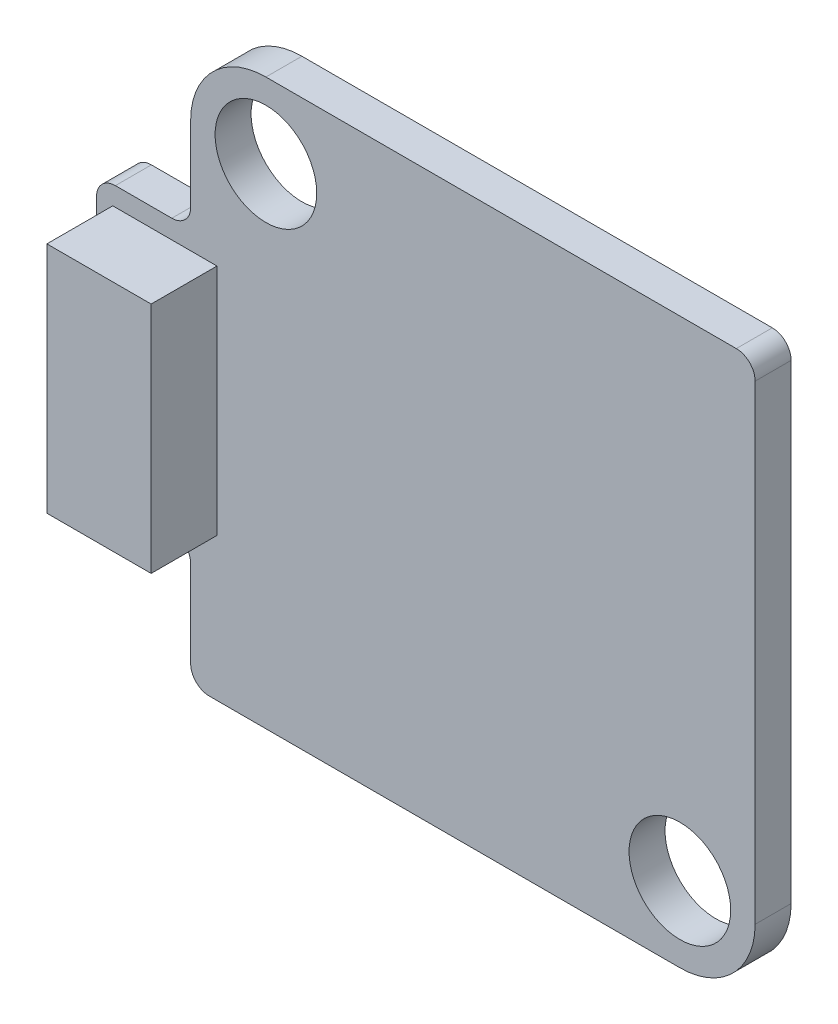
ISO-10303-21;
HEADER;
FILE_DESCRIPTION(('STEP AP214'),'2;1');
FILE_NAME('part.step','',(''),(''),'','','');
FILE_SCHEMA(('AUTOMOTIVE_DESIGN { 1 0 10303 214 1 1 1 1 }'));
ENDSEC;
DATA;
#1=APPLICATION_CONTEXT('core data for automotive mechanical design processes');
#2=APPLICATION_PROTOCOL_DEFINITION('international standard','automotive_design',2000,#1);
#3=PRODUCT_CONTEXT('',#1,'mechanical');
#4=PRODUCT('Part','Part','',(#3));
#5=PRODUCT_RELATED_PRODUCT_CATEGORY('part','',(#4));
#6=PRODUCT_DEFINITION_FORMATION('','',#4);
#7=PRODUCT_DEFINITION_CONTEXT('part definition',#1,'design');
#8=PRODUCT_DEFINITION('design','',#6,#7);
#9=PRODUCT_DEFINITION_SHAPE('','',#8);
#10=(LENGTH_UNIT() NAMED_UNIT(*) SI_UNIT(.MILLI.,.METRE.));
#11=(NAMED_UNIT(*) PLANE_ANGLE_UNIT() SI_UNIT($,.RADIAN.));
#12=(NAMED_UNIT(*) SI_UNIT($,.STERADIAN.) SOLID_ANGLE_UNIT());
#13=UNCERTAINTY_MEASURE_WITH_UNIT(LENGTH_MEASURE(1.E-05),#10,'distance_accuracy_value','');
#14=(GEOMETRIC_REPRESENTATION_CONTEXT(3) GLOBAL_UNCERTAINTY_ASSIGNED_CONTEXT((#13)) GLOBAL_UNIT_ASSIGNED_CONTEXT((#10,
#11,#12)) REPRESENTATION_CONTEXT('',''));
#15=CARTESIAN_POINT('',(0.,0.,0.));
#16=DIRECTION('',(0.,0.,1.));
#17=DIRECTION('',(1.,0.,0.));
#18=AXIS2_PLACEMENT_3D('',#15,#16,#17);
#19=CARTESIAN_POINT('',(-2.06999686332,9.999983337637,0.));
#20=DIRECTION('',(0.999999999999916,-4.09680252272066E-07,0.));
#21=DIRECTION('',(0.,0.,-1.));
#22=AXIS2_PLACEMENT_3D('',#19,#20,#21);
#23=PLANE('',#22);
#24=DIRECTION('',(-4.09680252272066E-07,-0.999999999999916,0.));
#25=VECTOR('',#24,1.);
#26=CARTESIAN_POINT('',(-2.06999686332,9.999983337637,0.));
#27=LINE('',#26,#25);
#28=CARTESIAN_POINT('',(-2.06999686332,9.999983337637,0.));
#29=VERTEX_POINT('',#28);
#30=CARTESIAN_POINT('',(-2.06999940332,3.800026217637,0.));
#31=VERTEX_POINT('',#30);
#32=EDGE_CURVE('P0_E11',#29,#31,#27,.T.);
#33=ORIENTED_EDGE('',*,*,#32,.T.);
#34=DIRECTION('',(0.,0.,1.));
#35=VECTOR('',#34,1.);
#36=CARTESIAN_POINT('',(-2.06999940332,3.800026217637,0.));
#37=LINE('',#36,#35);
#38=CARTESIAN_POINT('',(-2.06999940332,3.800026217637,1.74999904));
#39=VERTEX_POINT('',#38);
#40=EDGE_CURVE('P0_E28',#31,#39,#37,.T.);
#41=ORIENTED_EDGE('',*,*,#40,.T.);
#42=DIRECTION('',(-4.09680252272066E-07,-0.999999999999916,0.));
#43=VECTOR('',#42,1.);
#44=CARTESIAN_POINT('',(-2.06999686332,9.999983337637,1.74999904));
#45=LINE('',#44,#43);
#46=CARTESIAN_POINT('',(-2.06999686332,9.999983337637,1.74999904));
#47=VERTEX_POINT('',#46);
#48=EDGE_CURVE('P0_E87',#47,#39,#45,.T.);
#49=ORIENTED_EDGE('',*,*,#48,.F.);
#50=DIRECTION('',(0.,0.,1.));
#51=VECTOR('',#50,1.);
#52=CARTESIAN_POINT('',(-2.06999686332,9.999983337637,0.));
#53=LINE('',#52,#51);
#54=EDGE_CURVE('P0_E83',#29,#47,#53,.T.);
#55=ORIENTED_EDGE('',*,*,#54,.F.);
#56=EDGE_LOOP('',(#33,#41,#49,#55));
#57=FACE_BOUND('',#56,.T.);
#58=ADVANCED_FACE('P0_F17',(#57),#23,.F.);
#59=CARTESIAN_POINT('',(-2.06999940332,3.800026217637,0.));
#60=DIRECTION('',(0.,1.,0.));
#61=DIRECTION('',(1.,0.,0.));
#62=AXIS2_PLACEMENT_3D('',#59,#60,#61);
#63=PLANE('',#62);
#64=DIRECTION('',(1.,0.,0.));
#65=VECTOR('',#64,1.);
#66=CARTESIAN_POINT('',(-2.06999940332,3.800026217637,0.));
#67=LINE('',#66,#65);
#68=CARTESIAN_POINT('',(0.70002299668,3.800026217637,0.));
#69=VERTEX_POINT('',#68);
#70=EDGE_CURVE('P0_E104',#31,#69,#67,.T.);
#71=ORIENTED_EDGE('',*,*,#70,.T.);
#72=DIRECTION('',(0.,0.,1.));
#73=VECTOR('',#72,1.);
#74=CARTESIAN_POINT('',(0.70002299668,3.800026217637,0.));
#75=LINE('',#74,#73);
#76=CARTESIAN_POINT('',(0.70002299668,3.800026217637,1.74999904));
#77=VERTEX_POINT('',#76);
#78=EDGE_CURVE('P0_E75',#69,#77,#75,.T.);
#79=ORIENTED_EDGE('',*,*,#78,.T.);
#80=DIRECTION('',(1.,0.,0.));
#81=VECTOR('',#80,1.);
#82=CARTESIAN_POINT('',(-2.06999940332,3.800026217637,1.74999904));
#83=LINE('',#82,#81);
#84=EDGE_CURVE('P0_E89',#39,#77,#83,.T.);
#85=ORIENTED_EDGE('',*,*,#84,.F.);
#86=ORIENTED_EDGE('',*,*,#40,.F.);
#87=EDGE_LOOP('',(#71,#79,#85,#86));
#88=FACE_BOUND('',#87,.T.);
#89=ADVANCED_FACE('P0_F135',(#88),#63,.F.);
#90=CARTESIAN_POINT('',(0.70002299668,3.800026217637,0.));
#91=DIRECTION('',(-1.,0.,0.));
#92=DIRECTION('',(0.,0.,1.));
#93=AXIS2_PLACEMENT_3D('',#90,#91,#92);
#94=PLANE('',#93);
#95=DIRECTION('',(0.,1.,0.));
#96=VECTOR('',#95,1.);
#97=CARTESIAN_POINT('',(0.70002299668,3.800026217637,0.));
#98=LINE('',#97,#96);
#99=CARTESIAN_POINT('',(0.70002299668,9.999983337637,0.));
#100=VERTEX_POINT('',#99);
#101=EDGE_CURVE('P0_E112',#69,#100,#98,.T.);
#102=ORIENTED_EDGE('',*,*,#101,.T.);
#103=DIRECTION('',(0.,0.,1.));
#104=VECTOR('',#103,1.);
#105=CARTESIAN_POINT('',(0.70002299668,9.999983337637,0.));
#106=LINE('',#105,#104);
#107=CARTESIAN_POINT('',(0.70002299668,9.999983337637,1.74999904));
#108=VERTEX_POINT('',#107);
#109=EDGE_CURVE('P0_E21',#100,#108,#106,.T.);
#110=ORIENTED_EDGE('',*,*,#109,.T.);
#111=DIRECTION('',(0.,1.,0.));
#112=VECTOR('',#111,1.);
#113=CARTESIAN_POINT('',(0.70002299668,3.800026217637,1.74999904));
#114=LINE('',#113,#112);
#115=EDGE_CURVE('P0_E54',#77,#108,#114,.T.);
#116=ORIENTED_EDGE('',*,*,#115,.F.);
#117=ORIENTED_EDGE('',*,*,#78,.F.);
#118=EDGE_LOOP('',(#102,#110,#116,#117));
#119=FACE_BOUND('',#118,.T.);
#120=ADVANCED_FACE('P0_F121',(#119),#94,.F.);
#121=CARTESIAN_POINT('',(0.70002299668,9.999983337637,0.));
#122=DIRECTION('',(0.,-1.,0.));
#123=DIRECTION('',(0.,0.,-1.));
#124=AXIS2_PLACEMENT_3D('',#121,#122,#123);
#125=PLANE('',#124);
#126=DIRECTION('',(-1.,0.,0.));
#127=VECTOR('',#126,1.);
#128=CARTESIAN_POINT('',(0.70002299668,9.999983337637,0.));
#129=LINE('',#128,#127);
#130=EDGE_CURVE('P0_E93',#100,#29,#129,.T.);
#131=ORIENTED_EDGE('',*,*,#130,.T.);
#132=ORIENTED_EDGE('',*,*,#54,.T.);
#133=DIRECTION('',(-1.,0.,0.));
#134=VECTOR('',#133,1.);
#135=CARTESIAN_POINT('',(0.70002299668,9.999983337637,1.74999904));
#136=LINE('',#135,#134);
#137=EDGE_CURVE('P0_E91',#108,#47,#136,.T.);
#138=ORIENTED_EDGE('',*,*,#137,.F.);
#139=ORIENTED_EDGE('',*,*,#109,.F.);
#140=EDGE_LOOP('',(#131,#132,#138,#139));
#141=FACE_BOUND('',#140,.T.);
#142=ADVANCED_FACE('P0_F19',(#141),#125,.F.);
#143=CARTESIAN_POINT('',(-2.06999686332,9.999983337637,0.));
#144=DIRECTION('',(0.,0.,-1.));
#145=DIRECTION('',(0.,-1.,0.));
#146=AXIS2_PLACEMENT_3D('',#143,#144,#145);
#147=PLANE('',#146);
#148=ORIENTED_EDGE('',*,*,#130,.F.);
#149=ORIENTED_EDGE('',*,*,#101,.F.);
#150=ORIENTED_EDGE('',*,*,#70,.F.);
#151=ORIENTED_EDGE('',*,*,#32,.F.);
#152=EDGE_LOOP('',(#148,#149,#150,#151));
#153=FACE_BOUND('',#152,.T.);
#154=ADVANCED_FACE('P0_F123',(#153),#147,.T.);
#155=CARTESIAN_POINT('',(-2.06999686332,9.999983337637,1.74999904));
#156=DIRECTION('',(0.,0.,-1.));
#157=DIRECTION('',(0.,-1.,0.));
#158=AXIS2_PLACEMENT_3D('',#155,#156,#157);
#159=PLANE('',#158);
#160=ORIENTED_EDGE('',*,*,#48,.T.);
#161=ORIENTED_EDGE('',*,*,#84,.T.);
#162=ORIENTED_EDGE('',*,*,#115,.T.);
#163=ORIENTED_EDGE('',*,*,#137,.T.);
#164=EDGE_LOOP('',(#160,#161,#162,#163));
#165=FACE_BOUND('',#164,.T.);
#166=ADVANCED_FACE('P0_F96',(#165),#159,.F.);
#167=CLOSED_SHELL('',(#58,#89,#120,#142,#154,#166));
#168=MANIFOLD_SOLID_BREP('P0_B1',#167);
#169=CARTESIAN_POINT('',(-2.001519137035,3.798480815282,-0.95600012));
#170=DIRECTION('',(0.,0.,-1.));
#171=DIRECTION('',(0.00304751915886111,-0.999995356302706,0.));
#172=AXIS2_PLACEMENT_3D('',#169,#170,#171);
#173=CYLINDRICAL_SURFACE('',#172,0.49848317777);
#174=DIRECTION('',(0.,0.,1.));
#175=VECTOR('',#174,1.);
#176=CARTESIAN_POINT('',(-2.,3.299999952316,-0.95600012));
#177=LINE('',#176,#175);
#178=CARTESIAN_POINT('',(-2.,3.299999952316,-0.95600012));
#179=VERTEX_POINT('',#178);
#180=CARTESIAN_POINT('',(-2.,3.299999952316,0.));
#181=VERTEX_POINT('',#180);
#182=EDGE_CURVE('P1_E11',#179,#181,#177,.T.);
#183=ORIENTED_EDGE('',*,*,#182,.T.);
#184=CARTESIAN_POINT('',(-2.001519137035,3.798480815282,0.));
#185=DIRECTION('',(0.,0.,-1.));
#186=DIRECTION('',(0.00304751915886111,-0.999995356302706,0.));
#187=AXIS2_PLACEMENT_3D('',#184,#185,#186);
#188=CIRCLE('',#187,0.49848317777);
#189=CARTESIAN_POINT('',(-2.5,3.799999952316,0.));
#190=VERTEX_POINT('',#189);
#191=EDGE_CURVE('P1_E28',#181,#190,#188,.T.);
#192=ORIENTED_EDGE('',*,*,#191,.T.);
#193=DIRECTION('',(0.,0.,1.));
#194=VECTOR('',#193,1.);
#195=CARTESIAN_POINT('',(-2.5,3.799999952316,-0.95600012));
#196=LINE('',#195,#194);
#197=CARTESIAN_POINT('',(-2.5,3.799999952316,-0.95600012));
#198=VERTEX_POINT('',#197);
#199=EDGE_CURVE('P1_E260',#198,#190,#196,.T.);
#200=ORIENTED_EDGE('',*,*,#199,.F.);
#201=CARTESIAN_POINT('',(-2.001519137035,3.798480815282,-0.95600012));
#202=DIRECTION('',(0.,0.,-1.));
#203=DIRECTION('',(0.00304751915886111,-0.999995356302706,0.));
#204=AXIS2_PLACEMENT_3D('',#201,#202,#203);
#205=CIRCLE('',#204,0.49848317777);
#206=EDGE_CURVE('P1_E315',#179,#198,#205,.T.);
#207=ORIENTED_EDGE('',*,*,#206,.F.);
#208=EDGE_LOOP('',(#183,#192,#200,#207));
#209=FACE_BOUND('',#208,.T.);
#210=ADVANCED_FACE('P1_F17',(#209),#173,.T.);
#211=CARTESIAN_POINT('',(-2.5,3.799999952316,-0.95600012));
#212=DIRECTION('',(-1.,0.,0.));
#213=DIRECTION('',(0.,0.,1.));
#214=AXIS2_PLACEMENT_3D('',#211,#212,#213);
#215=PLANE('',#214);
#216=ORIENTED_EDGE('',*,*,#199,.T.);
#217=DIRECTION('',(0.,1.,0.));
#218=VECTOR('',#217,1.);
#219=CARTESIAN_POINT('',(-2.5,3.799999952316,0.));
#220=LINE('',#219,#218);
#221=CARTESIAN_POINT('',(-2.5,10.,0.));
#222=VERTEX_POINT('',#221);
#223=EDGE_CURVE('P1_E368',#190,#222,#220,.T.);
#224=ORIENTED_EDGE('',*,*,#223,.T.);
#225=DIRECTION('',(0.,0.,1.));
#226=VECTOR('',#225,1.);
#227=CARTESIAN_POINT('',(-2.5,10.,-0.95600012));
#228=LINE('',#227,#226);
#229=CARTESIAN_POINT('',(-2.5,10.,-0.95600012));
#230=VERTEX_POINT('',#229);
#231=EDGE_CURVE('P1_E332',#230,#222,#228,.T.);
#232=ORIENTED_EDGE('',*,*,#231,.F.);
#233=DIRECTION('',(0.,1.,0.));
#234=VECTOR('',#233,1.);
#235=CARTESIAN_POINT('',(-2.5,3.799999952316,-0.95600012));
#236=LINE('',#235,#234);
#237=EDGE_CURVE('P1_E114',#198,#230,#236,.T.);
#238=ORIENTED_EDGE('',*,*,#237,.F.);
#239=EDGE_LOOP('',(#216,#224,#232,#238));
#240=FACE_BOUND('',#239,.T.);
#241=ADVANCED_FACE('P1_F429',(#240),#215,.T.);
#242=CARTESIAN_POINT('',(-2.001519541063,10.001519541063,-0.95600012));
#243=DIRECTION('',(0.,0.,-1.));
#244=DIRECTION('',(-0.999995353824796,-0.00304833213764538,0.));
#245=AXIS2_PLACEMENT_3D('',#242,#243,#244);
#246=CYLINDRICAL_SURFACE('',#245,0.498482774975);
#247=ORIENTED_EDGE('',*,*,#231,.T.);
#248=CARTESIAN_POINT('',(-2.001519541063,10.001519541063,0.));
#249=DIRECTION('',(0.,0.,-1.));
#250=DIRECTION('',(-0.999995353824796,-0.00304833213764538,0.));
#251=AXIS2_PLACEMENT_3D('',#248,#249,#250);
#252=CIRCLE('',#251,0.498482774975);
#253=CARTESIAN_POINT('',(-2.,10.5,0.));
#254=VERTEX_POINT('',#253);
#255=EDGE_CURVE('P1_E329',#222,#254,#252,.T.);
#256=ORIENTED_EDGE('',*,*,#255,.T.);
#257=DIRECTION('',(0.,0.,1.));
#258=VECTOR('',#257,1.);
#259=CARTESIAN_POINT('',(-2.,10.5,-0.95600012));
#260=LINE('',#259,#258);
#261=CARTESIAN_POINT('',(-2.,10.5,-0.95600012));
#262=VERTEX_POINT('',#261);
#263=EDGE_CURVE('P1_E129',#262,#254,#260,.T.);
#264=ORIENTED_EDGE('',*,*,#263,.F.);
#265=CARTESIAN_POINT('',(-2.001519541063,10.001519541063,-0.95600012));
#266=DIRECTION('',(0.,0.,-1.));
#267=DIRECTION('',(-0.999995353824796,-0.00304833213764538,0.));
#268=AXIS2_PLACEMENT_3D('',#265,#266,#267);
#269=CIRCLE('',#268,0.498482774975);
#270=EDGE_CURVE('P1_E254',#230,#262,#269,.T.);
#271=ORIENTED_EDGE('',*,*,#270,.F.);
#272=EDGE_LOOP('',(#247,#256,#264,#271));
#273=FACE_BOUND('',#272,.T.);
#274=ADVANCED_FACE('P1_F435',(#273),#246,.T.);
#275=CARTESIAN_POINT('',(-2.,10.5,-0.95600012));
#276=DIRECTION('',(0.,1.,0.));
#277=DIRECTION('',(1.,0.,0.));
#278=AXIS2_PLACEMENT_3D('',#275,#276,#277);
#279=PLANE('',#278);
#280=ORIENTED_EDGE('',*,*,#263,.T.);
#281=DIRECTION('',(1.,0.,0.));
#282=VECTOR('',#281,1.);
#283=CARTESIAN_POINT('',(-2.,10.5,0.));
#284=LINE('',#283,#282);
#285=CARTESIAN_POINT('',(-0.5,10.5,0.));
#286=VERTEX_POINT('',#285);
#287=EDGE_CURVE('P1_E229',#254,#286,#284,.T.);
#288=ORIENTED_EDGE('',*,*,#287,.T.);
#289=DIRECTION('',(0.,0.,1.));
#290=VECTOR('',#289,1.);
#291=CARTESIAN_POINT('',(-0.5,10.5,-0.95600012));
#292=LINE('',#291,#290);
#293=CARTESIAN_POINT('',(-0.5,10.5,-0.95600012));
#294=VERTEX_POINT('',#293);
#295=EDGE_CURVE('P1_E221',#294,#286,#292,.T.);
#296=ORIENTED_EDGE('',*,*,#295,.F.);
#297=DIRECTION('',(1.,0.,0.));
#298=VECTOR('',#297,1.);
#299=CARTESIAN_POINT('',(-2.,10.5,-0.95600012));
#300=LINE('',#299,#298);
#301=EDGE_CURVE('P1_E257',#262,#294,#300,.T.);
#302=ORIENTED_EDGE('',*,*,#301,.F.);
#303=EDGE_LOOP('',(#280,#288,#296,#302));
#304=FACE_BOUND('',#303,.T.);
#305=ADVANCED_FACE('P1_F232',(#304),#279,.T.);
#306=CARTESIAN_POINT('',(-0.498480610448,10.998480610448,-0.95600012));
#307=DIRECTION('',(0.,0.,-1.));
#308=DIRECTION('',(-0.00304802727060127,-0.99999535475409,0.));
#309=AXIS2_PLACEMENT_3D('',#306,#307,#308);
#310=CYLINDRICAL_SURFACE('',#309,0.498482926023);
#311=ORIENTED_EDGE('',*,*,#295,.T.);
#312=CARTESIAN_POINT('',(-0.498480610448,10.998480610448,0.));
#313=DIRECTION('',(0.,0.,1.));
#314=DIRECTION('',(-0.00304802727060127,-0.99999535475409,0.));
#315=AXIS2_PLACEMENT_3D('',#312,#313,#314);
#316=CIRCLE('',#315,0.498482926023);
#317=CARTESIAN_POINT('',(0.,11.,0.));
#318=VERTEX_POINT('',#317);
#319=EDGE_CURVE('P1_E225',#286,#318,#316,.T.);
#320=ORIENTED_EDGE('',*,*,#319,.T.);
#321=DIRECTION('',(0.,0.,1.));
#322=VECTOR('',#321,1.);
#323=CARTESIAN_POINT('',(0.,11.,-0.95600012));
#324=LINE('',#323,#322);
#325=CARTESIAN_POINT('',(0.,11.,-0.95600012));
#326=VERTEX_POINT('',#325);
#327=EDGE_CURVE('P1_E242',#326,#318,#324,.T.);
#328=ORIENTED_EDGE('',*,*,#327,.F.);
#329=CARTESIAN_POINT('',(-0.498480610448,10.998480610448,-0.95600012));
#330=DIRECTION('',(0.,0.,1.));
#331=DIRECTION('',(-0.00304802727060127,-0.99999535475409,0.));
#332=AXIS2_PLACEMENT_3D('',#329,#330,#331);
#333=CIRCLE('',#332,0.498482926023);
#334=EDGE_CURVE('P1_E227',#294,#326,#333,.T.);
#335=ORIENTED_EDGE('',*,*,#334,.F.);
#336=EDGE_LOOP('',(#311,#320,#328,#335));
#337=FACE_BOUND('',#336,.T.);
#338=ADVANCED_FACE('P1_F222',(#337),#310,.F.);
#339=CARTESIAN_POINT('',(0.,11.,-0.95600012));
#340=DIRECTION('',(-1.,0.,0.));
#341=DIRECTION('',(0.,0.,1.));
#342=AXIS2_PLACEMENT_3D('',#339,#340,#341);
#343=PLANE('',#342);
#344=ORIENTED_EDGE('',*,*,#327,.T.);
#345=DIRECTION('',(0.,1.,0.));
#346=VECTOR('',#345,1.);
#347=CARTESIAN_POINT('',(0.,11.,0.));
#348=LINE('',#347,#346);
#349=CARTESIAN_POINT('',(0.,13.,0.));
#350=VERTEX_POINT('',#349);
#351=EDGE_CURVE('P1_E240',#318,#350,#348,.T.);
#352=ORIENTED_EDGE('',*,*,#351,.T.);
#353=DIRECTION('',(0.,0.,1.));
#354=VECTOR('',#353,1.);
#355=CARTESIAN_POINT('',(0.,13.,-0.95600012));
#356=LINE('',#355,#354);
#357=CARTESIAN_POINT('',(0.,13.,-0.95600012));
#358=VERTEX_POINT('',#357);
#359=EDGE_CURVE('P1_E262',#358,#350,#356,.T.);
#360=ORIENTED_EDGE('',*,*,#359,.F.);
#361=DIRECTION('',(0.,1.,0.));
#362=VECTOR('',#361,1.);
#363=CARTESIAN_POINT('',(0.,11.,-0.95600012));
#364=LINE('',#363,#362);
#365=EDGE_CURVE('P1_E287',#326,#358,#364,.T.);
#366=ORIENTED_EDGE('',*,*,#365,.F.);
#367=EDGE_LOOP('',(#344,#352,#360,#366));
#368=FACE_BOUND('',#367,.T.);
#369=ADVANCED_FACE('P1_F439',(#368),#343,.T.);
#370=CARTESIAN_POINT('',(2.000730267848,12.999269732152,-0.95600012));
#371=DIRECTION('',(0.,0.,-1.));
#372=DIRECTION('',(-0.999999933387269,0.000365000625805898,0.));
#373=AXIS2_PLACEMENT_3D('',#370,#371,#372);
#374=CYLINDRICAL_SURFACE('',#373,2.000730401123);
#375=ORIENTED_EDGE('',*,*,#359,.T.);
#376=CARTESIAN_POINT('',(2.000730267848,12.999269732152,0.));
#377=DIRECTION('',(0.,0.,-1.));
#378=DIRECTION('',(-0.999999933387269,0.000365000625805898,0.));
#379=AXIS2_PLACEMENT_3D('',#376,#377,#378);
#380=CIRCLE('',#379,2.000730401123);
#381=CARTESIAN_POINT('',(2.,15.,0.));
#382=VERTEX_POINT('',#381);
#383=EDGE_CURVE('P1_E280',#350,#382,#380,.T.);
#384=ORIENTED_EDGE('',*,*,#383,.T.);
#385=DIRECTION('',(0.,0.,1.));
#386=VECTOR('',#385,1.);
#387=CARTESIAN_POINT('',(2.,15.,-0.95600012));
#388=LINE('',#387,#386);
#389=CARTESIAN_POINT('',(2.,15.,-0.95600012));
#390=VERTEX_POINT('',#389);
#391=EDGE_CURVE('P1_E284',#390,#382,#388,.T.);
#392=ORIENTED_EDGE('',*,*,#391,.F.);
#393=CARTESIAN_POINT('',(2.000730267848,12.999269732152,-0.95600012));
#394=DIRECTION('',(0.,0.,-1.));
#395=DIRECTION('',(-0.999999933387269,0.000365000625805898,0.));
#396=AXIS2_PLACEMENT_3D('',#393,#394,#395);
#397=CIRCLE('',#396,2.000730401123);
#398=EDGE_CURVE('P1_E253',#358,#390,#397,.T.);
#399=ORIENTED_EDGE('',*,*,#398,.F.);
#400=EDGE_LOOP('',(#375,#384,#392,#399));
#401=FACE_BOUND('',#400,.T.);
#402=ADVANCED_FACE('P1_F442',(#401),#374,.T.);
#403=CARTESIAN_POINT('',(2.,15.,-0.95600012));
#404=DIRECTION('',(0.,1.,0.));
#405=DIRECTION('',(1.,0.,0.));
#406=AXIS2_PLACEMENT_3D('',#403,#404,#405);
#407=PLANE('',#406);
#408=ORIENTED_EDGE('',*,*,#391,.T.);
#409=DIRECTION('',(1.,0.,0.));
#410=VECTOR('',#409,1.);
#411=CARTESIAN_POINT('',(2.,15.,0.));
#412=LINE('',#411,#410);
#413=CARTESIAN_POINT('',(14.5,15.,0.));
#414=VERTEX_POINT('',#413);
#415=EDGE_CURVE('P1_E290',#382,#414,#412,.T.);
#416=ORIENTED_EDGE('',*,*,#415,.T.);
#417=DIRECTION('',(0.,0.,1.));
#418=VECTOR('',#417,1.);
#419=CARTESIAN_POINT('',(14.5,15.,-0.95600012));
#420=LINE('',#419,#418);
#421=CARTESIAN_POINT('',(14.5,15.,-0.95600012));
#422=VERTEX_POINT('',#421);
#423=EDGE_CURVE('P1_E177',#422,#414,#420,.T.);
#424=ORIENTED_EDGE('',*,*,#423,.F.);
#425=DIRECTION('',(1.,0.,0.));
#426=VECTOR('',#425,1.);
#427=CARTESIAN_POINT('',(2.,15.,-0.95600012));
#428=LINE('',#427,#426);
#429=EDGE_CURVE('P1_E189',#390,#422,#428,.T.);
#430=ORIENTED_EDGE('',*,*,#429,.F.);
#431=EDGE_LOOP('',(#408,#416,#424,#430));
#432=FACE_BOUND('',#431,.T.);
#433=ADVANCED_FACE('P1_F391',(#432),#407,.T.);
#434=CARTESIAN_POINT('',(14.501519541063,14.501519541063,-0.95600012));
#435=DIRECTION('',(0.,0.,-1.));
#436=DIRECTION('',(-0.00304833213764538,0.999995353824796,0.));
#437=AXIS2_PLACEMENT_3D('',#434,#435,#436);
#438=CYLINDRICAL_SURFACE('',#437,0.498482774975);
#439=ORIENTED_EDGE('',*,*,#423,.T.);
#440=CARTESIAN_POINT('',(14.501519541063,14.501519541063,0.));
#441=DIRECTION('',(0.,0.,-1.));
#442=DIRECTION('',(-0.00304833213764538,0.999995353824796,0.));
#443=AXIS2_PLACEMENT_3D('',#440,#441,#442);
#444=CIRCLE('',#443,0.498482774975);
#445=CARTESIAN_POINT('',(15.,14.5,0.));
#446=VERTEX_POINT('',#445);
#447=EDGE_CURVE('P1_E291',#414,#446,#444,.T.);
#448=ORIENTED_EDGE('',*,*,#447,.T.);
#449=DIRECTION('',(0.,0.,1.));
#450=VECTOR('',#449,1.);
#451=CARTESIAN_POINT('',(15.,14.5,-0.95600012));
#452=LINE('',#451,#450);
#453=CARTESIAN_POINT('',(15.,14.5,-0.95600012));
#454=VERTEX_POINT('',#453);
#455=EDGE_CURVE('P1_E339',#454,#446,#452,.T.);
#456=ORIENTED_EDGE('',*,*,#455,.F.);
#457=CARTESIAN_POINT('',(14.501519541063,14.501519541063,-0.95600012));
#458=DIRECTION('',(0.,0.,-1.));
#459=DIRECTION('',(-0.00304833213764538,0.999995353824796,0.));
#460=AXIS2_PLACEMENT_3D('',#457,#458,#459);
#461=CIRCLE('',#460,0.498482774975);
#462=EDGE_CURVE('P1_E201',#422,#454,#461,.T.);
#463=ORIENTED_EDGE('',*,*,#462,.F.);
#464=EDGE_LOOP('',(#439,#448,#456,#463));
#465=FACE_BOUND('',#464,.T.);
#466=ADVANCED_FACE('P1_F395',(#465),#438,.T.);
#467=CARTESIAN_POINT('',(15.,14.5,-0.95600012));
#468=DIRECTION('',(1.,0.,0.));
#469=DIRECTION('',(0.,1.,0.));
#470=AXIS2_PLACEMENT_3D('',#467,#468,#469);
#471=PLANE('',#470);
#472=ORIENTED_EDGE('',*,*,#455,.T.);
#473=DIRECTION('',(0.,-1.,0.));
#474=VECTOR('',#473,1.);
#475=CARTESIAN_POINT('',(15.,14.5,0.));
#476=LINE('',#475,#474);
#477=CARTESIAN_POINT('',(15.,2.,0.));
#478=VERTEX_POINT('',#477);
#479=EDGE_CURVE('P1_E355',#446,#478,#476,.T.);
#480=ORIENTED_EDGE('',*,*,#479,.T.);
#481=DIRECTION('',(0.,0.,1.));
#482=VECTOR('',#481,1.);
#483=CARTESIAN_POINT('',(15.,2.,-0.95600012));
#484=LINE('',#483,#482);
#485=CARTESIAN_POINT('',(15.,2.,-0.95600012));
#486=VERTEX_POINT('',#485);
#487=EDGE_CURVE('P1_E210',#486,#478,#484,.T.);
#488=ORIENTED_EDGE('',*,*,#487,.F.);
#489=DIRECTION('',(0.,-1.,0.));
#490=VECTOR('',#489,1.);
#491=CARTESIAN_POINT('',(15.,14.5,-0.95600012));
#492=LINE('',#491,#490);
#493=EDGE_CURVE('P1_E266',#454,#486,#492,.T.);
#494=ORIENTED_EDGE('',*,*,#493,.F.);
#495=EDGE_LOOP('',(#472,#480,#488,#494));
#496=FACE_BOUND('',#495,.T.);
#497=ADVANCED_FACE('P1_F400',(#496),#471,.T.);
#498=CARTESIAN_POINT('',(12.999269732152,2.000730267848,-0.95600012));
#499=DIRECTION('',(0.,0.,-1.));
#500=DIRECTION('',(0.999999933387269,-0.000365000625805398,0.));
#501=AXIS2_PLACEMENT_3D('',#498,#499,#500);
#502=CYLINDRICAL_SURFACE('',#501,2.000730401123);
#503=ORIENTED_EDGE('',*,*,#487,.T.);
#504=CARTESIAN_POINT('',(12.999269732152,2.000730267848,0.));
#505=DIRECTION('',(0.,0.,-1.));
#506=DIRECTION('',(0.999999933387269,-0.000365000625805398,0.));
#507=AXIS2_PLACEMENT_3D('',#504,#505,#506);
#508=CIRCLE('',#507,2.000730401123);
#509=CARTESIAN_POINT('',(13.,0.,0.));
#510=VERTEX_POINT('',#509);
#511=EDGE_CURVE('P1_E272',#478,#510,#508,.T.);
#512=ORIENTED_EDGE('',*,*,#511,.T.);
#513=DIRECTION('',(0.,0.,1.));
#514=VECTOR('',#513,1.);
#515=CARTESIAN_POINT('',(13.,0.,-0.95600012));
#516=LINE('',#515,#514);
#517=CARTESIAN_POINT('',(13.,0.,-0.95600012));
#518=VERTEX_POINT('',#517);
#519=EDGE_CURVE('P1_E269',#518,#510,#516,.T.);
#520=ORIENTED_EDGE('',*,*,#519,.F.);
#521=CARTESIAN_POINT('',(12.999269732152,2.000730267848,-0.95600012));
#522=DIRECTION('',(0.,0.,-1.));
#523=DIRECTION('',(0.999999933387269,-0.000365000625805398,0.));
#524=AXIS2_PLACEMENT_3D('',#521,#522,#523);
#525=CIRCLE('',#524,2.000730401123);
#526=EDGE_CURVE('P1_E21',#486,#518,#525,.T.);
#527=ORIENTED_EDGE('',*,*,#526,.F.);
#528=EDGE_LOOP('',(#503,#512,#520,#527));
#529=FACE_BOUND('',#528,.T.);
#530=ADVANCED_FACE('P1_F406',(#529),#502,.T.);
#531=CARTESIAN_POINT('',(13.,0.,-0.95600012));
#532=DIRECTION('',(0.,-1.,0.));
#533=DIRECTION('',(0.,0.,-1.));
#534=AXIS2_PLACEMENT_3D('',#531,#532,#533);
#535=PLANE('',#534);
#536=ORIENTED_EDGE('',*,*,#519,.T.);
#537=DIRECTION('',(-1.,0.,0.));
#538=VECTOR('',#537,1.);
#539=CARTESIAN_POINT('',(13.,0.,0.));
#540=LINE('',#539,#538);
#541=CARTESIAN_POINT('',(0.5,0.,0.));
#542=VERTEX_POINT('',#541);
#543=EDGE_CURVE('P1_E273',#510,#542,#540,.T.);
#544=ORIENTED_EDGE('',*,*,#543,.T.);
#545=DIRECTION('',(0.,0.,1.));
#546=VECTOR('',#545,1.);
#547=CARTESIAN_POINT('',(0.5,0.,-0.95600012));
#548=LINE('',#547,#546);
#549=CARTESIAN_POINT('',(0.5,0.,-0.95600012));
#550=VERTEX_POINT('',#549);
#551=EDGE_CURVE('P1_E295',#550,#542,#548,.T.);
#552=ORIENTED_EDGE('',*,*,#551,.F.);
#553=DIRECTION('',(-1.,0.,0.));
#554=VECTOR('',#553,1.);
#555=CARTESIAN_POINT('',(13.,0.,-0.95600012));
#556=LINE('',#555,#554);
#557=EDGE_CURVE('P1_E312',#518,#550,#556,.T.);
#558=ORIENTED_EDGE('',*,*,#557,.F.);
#559=EDGE_LOOP('',(#536,#544,#552,#558));
#560=FACE_BOUND('',#559,.T.);
#561=ADVANCED_FACE('P1_F409',(#560),#535,.T.);
#562=CARTESIAN_POINT('',(0.498480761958,0.498480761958,-0.95600012));
#563=DIRECTION('',(0.,0.,-1.));
#564=DIRECTION('',(0.00304772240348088,-0.999995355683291,0.));
#565=AXIS2_PLACEMENT_3D('',#562,#563,#564);
#566=CYLINDRICAL_SURFACE('',#565,0.498483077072);
#567=ORIENTED_EDGE('',*,*,#551,.T.);
#568=CARTESIAN_POINT('',(0.498480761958,0.498480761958,0.));
#569=DIRECTION('',(0.,0.,-1.));
#570=DIRECTION('',(0.00304772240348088,-0.999995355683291,0.));
#571=AXIS2_PLACEMENT_3D('',#568,#569,#570);
#572=CIRCLE('',#571,0.498483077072);
#573=CARTESIAN_POINT('',(0.,0.5,0.));
#574=VERTEX_POINT('',#573);
#575=EDGE_CURVE('P1_E321',#542,#574,#572,.T.);
#576=ORIENTED_EDGE('',*,*,#575,.T.);
#577=DIRECTION('',(0.,0.,1.));
#578=VECTOR('',#577,1.);
#579=CARTESIAN_POINT('',(0.,0.5,-0.95600012));
#580=LINE('',#579,#578);
#581=CARTESIAN_POINT('',(0.,0.5,-0.95600012));
#582=VERTEX_POINT('',#581);
#583=EDGE_CURVE('P1_E70',#582,#574,#580,.T.);
#584=ORIENTED_EDGE('',*,*,#583,.F.);
#585=CARTESIAN_POINT('',(0.498480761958,0.498480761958,-0.95600012));
#586=DIRECTION('',(0.,0.,-1.));
#587=DIRECTION('',(0.00304772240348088,-0.999995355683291,0.));
#588=AXIS2_PLACEMENT_3D('',#585,#586,#587);
#589=CIRCLE('',#588,0.498483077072);
#590=EDGE_CURVE('P1_E83',#550,#582,#589,.T.);
#591=ORIENTED_EDGE('',*,*,#590,.F.);
#592=EDGE_LOOP('',(#567,#576,#584,#591));
#593=FACE_BOUND('',#592,.T.);
#594=ADVANCED_FACE('P1_F412',(#593),#566,.T.);
#595=CARTESIAN_POINT('',(0.,0.5,-0.95600012));
#596=DIRECTION('',(-1.,0.,0.));
#597=DIRECTION('',(0.,0.,1.));
#598=AXIS2_PLACEMENT_3D('',#595,#596,#597);
#599=PLANE('',#598);
#600=ORIENTED_EDGE('',*,*,#583,.T.);
#601=DIRECTION('',(0.,1.,0.));
#602=VECTOR('',#601,1.);
#603=CARTESIAN_POINT('',(0.,0.5,0.));
#604=LINE('',#603,#602);
#605=CARTESIAN_POINT('',(0.,2.799999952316,0.));
#606=VERTEX_POINT('',#605);
#607=EDGE_CURVE('P1_E322',#574,#606,#604,.T.);
#608=ORIENTED_EDGE('',*,*,#607,.T.);
#609=DIRECTION('',(0.,0.,1.));
#610=VECTOR('',#609,1.);
#611=CARTESIAN_POINT('',(0.,2.799999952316,-0.95600012));
#612=LINE('',#611,#610);
#613=CARTESIAN_POINT('',(0.,2.799999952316,-0.95600012));
#614=VERTEX_POINT('',#613);
#615=EDGE_CURVE('P1_E357',#614,#606,#612,.T.);
#616=ORIENTED_EDGE('',*,*,#615,.F.);
#617=DIRECTION('',(0.,1.,0.));
#618=VECTOR('',#617,1.);
#619=CARTESIAN_POINT('',(0.,0.5,-0.95600012));
#620=LINE('',#619,#618);
#621=EDGE_CURVE('P1_E341',#582,#614,#620,.T.);
#622=ORIENTED_EDGE('',*,*,#621,.F.);
#623=EDGE_LOOP('',(#600,#608,#616,#622));
#624=FACE_BOUND('',#623,.T.);
#625=ADVANCED_FACE('P1_F414',(#624),#599,.T.);
#626=CARTESIAN_POINT('',(-0.498480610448,2.801519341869,-0.95600012));
#627=DIRECTION('',(0.,0.,-1.));
#628=DIRECTION('',(0.99999535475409,-0.00304802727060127,0.));
#629=AXIS2_PLACEMENT_3D('',#626,#627,#628);
#630=CYLINDRICAL_SURFACE('',#629,0.498482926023);
#631=ORIENTED_EDGE('',*,*,#615,.T.);
#632=CARTESIAN_POINT('',(-0.498480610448,2.801519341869,0.));
#633=DIRECTION('',(0.,0.,1.));
#634=DIRECTION('',(0.99999535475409,-0.00304802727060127,0.));
#635=AXIS2_PLACEMENT_3D('',#632,#633,#634);
#636=CIRCLE('',#635,0.498482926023);
#637=CARTESIAN_POINT('',(-0.5,3.299999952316,0.));
#638=VERTEX_POINT('',#637);
#639=EDGE_CURVE('P1_E309',#606,#638,#636,.T.);
#640=ORIENTED_EDGE('',*,*,#639,.T.);
#641=DIRECTION('',(0.,0.,1.));
#642=VECTOR('',#641,1.);
#643=CARTESIAN_POINT('',(-0.5,3.299999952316,-0.95600012));
#644=LINE('',#643,#642);
#645=CARTESIAN_POINT('',(-0.5,3.299999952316,-0.95600012));
#646=VERTEX_POINT('',#645);
#647=EDGE_CURVE('P1_E305',#646,#638,#644,.T.);
#648=ORIENTED_EDGE('',*,*,#647,.F.);
#649=CARTESIAN_POINT('',(-0.498480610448,2.801519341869,-0.95600012));
#650=DIRECTION('',(0.,0.,1.));
#651=DIRECTION('',(0.99999535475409,-0.00304802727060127,0.));
#652=AXIS2_PLACEMENT_3D('',#649,#650,#651);
#653=CIRCLE('',#652,0.498482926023);
#654=EDGE_CURVE('P1_E326',#614,#646,#653,.T.);
#655=ORIENTED_EDGE('',*,*,#654,.F.);
#656=EDGE_LOOP('',(#631,#640,#648,#655));
#657=FACE_BOUND('',#656,.T.);
#658=ADVANCED_FACE('P1_F419',(#657),#630,.F.);
#659=CARTESIAN_POINT('',(-0.5,3.299999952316,-0.95600012));
#660=DIRECTION('',(0.,-1.,0.));
#661=DIRECTION('',(0.,0.,-1.));
#662=AXIS2_PLACEMENT_3D('',#659,#660,#661);
#663=PLANE('',#662);
#664=ORIENTED_EDGE('',*,*,#647,.T.);
#665=DIRECTION('',(-1.,0.,0.));
#666=VECTOR('',#665,1.);
#667=CARTESIAN_POINT('',(-0.5,3.299999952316,0.));
#668=LINE('',#667,#666);
#669=EDGE_CURVE('P1_E278',#638,#181,#668,.T.);
#670=ORIENTED_EDGE('',*,*,#669,.T.);
#671=ORIENTED_EDGE('',*,*,#182,.F.);
#672=DIRECTION('',(-1.,0.,0.));
#673=VECTOR('',#672,1.);
#674=CARTESIAN_POINT('',(-0.5,3.299999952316,-0.95600012));
#675=LINE('',#674,#673);
#676=EDGE_CURVE('P1_E300',#646,#179,#675,.T.);
#677=ORIENTED_EDGE('',*,*,#676,.F.);
#678=EDGE_LOOP('',(#664,#670,#671,#677));
#679=FACE_BOUND('',#678,.T.);
#680=ADVANCED_FACE('P1_F424',(#679),#663,.T.);
#681=CARTESIAN_POINT('',(2.0000214,12.9999994,-0.95600012));
#682=DIRECTION('',(0.,0.,-1.));
#683=DIRECTION('',(1.,0.,0.));
#684=AXIS2_PLACEMENT_3D('',#681,#682,#683);
#685=CYLINDRICAL_SURFACE('',#684,1.34999984);
#686=DIRECTION('',(0.,0.,1.));
#687=VECTOR('',#686,1.);
#688=CARTESIAN_POINT('',(3.35002124,12.9999994,-0.95600012));
#689=LINE('',#688,#687);
#690=CARTESIAN_POINT('',(3.35002124,12.9999994,-0.95600012));
#691=VERTEX_POINT('',#690);
#692=CARTESIAN_POINT('',(3.35002124,12.9999994,0.));
#693=VERTEX_POINT('',#692);
#694=EDGE_CURVE('P1_E274',#691,#693,#689,.T.);
#695=ORIENTED_EDGE('',*,*,#694,.T.);
#696=CARTESIAN_POINT('',(2.0000214,12.9999994,0.));
#697=DIRECTION('',(0.,0.,1.));
#698=DIRECTION('',(1.,0.,0.));
#699=AXIS2_PLACEMENT_3D('',#696,#697,#698);
#700=CIRCLE('',#699,1.34999984);
#701=EDGE_CURVE('P1_E279',#693,#693,#700,.T.);
#702=ORIENTED_EDGE('',*,*,#701,.T.);
#703=ORIENTED_EDGE('',*,*,#694,.F.);
#704=CARTESIAN_POINT('',(2.0000214,12.9999994,-0.95600012));
#705=DIRECTION('',(0.,0.,1.));
#706=DIRECTION('',(1.,0.,0.));
#707=AXIS2_PLACEMENT_3D('',#704,#705,#706);
#708=CIRCLE('',#707,1.34999984);
#709=EDGE_CURVE('P1_E296',#691,#691,#708,.T.);
#710=ORIENTED_EDGE('',*,*,#709,.F.);
#711=EDGE_LOOP('',(#695,#702,#703,#710));
#712=FACE_BOUND('',#711,.T.);
#713=ADVANCED_FACE('P1_F19',(#712),#685,.F.);
#714=CARTESIAN_POINT('',(12.9999994,2.0000214,-0.95600012));
#715=DIRECTION('',(0.,0.,-1.));
#716=DIRECTION('',(1.,0.,0.));
#717=AXIS2_PLACEMENT_3D('',#714,#715,#716);
#718=CYLINDRICAL_SURFACE('',#717,1.34999984);
#719=DIRECTION('',(0.,0.,1.));
#720=VECTOR('',#719,1.);
#721=CARTESIAN_POINT('',(14.34999924,2.0000214,-0.95600012));
#722=LINE('',#721,#720);
#723=CARTESIAN_POINT('',(14.34999924,2.0000214,-0.95600012));
#724=VERTEX_POINT('',#723);
#725=CARTESIAN_POINT('',(14.34999924,2.0000214,0.));
#726=VERTEX_POINT('',#725);
#727=EDGE_CURVE('P1_E383',#724,#726,#722,.T.);
#728=ORIENTED_EDGE('',*,*,#727,.T.);
#729=CARTESIAN_POINT('',(12.9999994,2.0000214,0.));
#730=DIRECTION('',(0.,0.,1.));
#731=DIRECTION('',(1.,0.,0.));
#732=AXIS2_PLACEMENT_3D('',#729,#730,#731);
#733=CIRCLE('',#732,1.34999984);
#734=EDGE_CURVE('P1_E318',#726,#726,#733,.T.);
#735=ORIENTED_EDGE('',*,*,#734,.T.);
#736=ORIENTED_EDGE('',*,*,#727,.F.);
#737=CARTESIAN_POINT('',(12.9999994,2.0000214,-0.95600012));
#738=DIRECTION('',(0.,0.,1.));
#739=DIRECTION('',(1.,0.,0.));
#740=AXIS2_PLACEMENT_3D('',#737,#738,#739);
#741=CIRCLE('',#740,1.34999984);
#742=EDGE_CURVE('P1_E301',#724,#724,#741,.T.);
#743=ORIENTED_EDGE('',*,*,#742,.F.);
#744=EDGE_LOOP('',(#728,#735,#736,#743));
#745=FACE_BOUND('',#744,.T.);
#746=ADVANCED_FACE('P1_F482',(#745),#718,.F.);
#747=CARTESIAN_POINT('',(-2.,3.299999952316,-0.95600012));
#748=DIRECTION('',(0.,0.,1.));
#749=DIRECTION('',(1.,0.,0.));
#750=AXIS2_PLACEMENT_3D('',#747,#748,#749);
#751=PLANE('',#750);
#752=ORIENTED_EDGE('',*,*,#206,.T.);
#753=ORIENTED_EDGE('',*,*,#237,.T.);
#754=ORIENTED_EDGE('',*,*,#270,.T.);
#755=ORIENTED_EDGE('',*,*,#301,.T.);
#756=ORIENTED_EDGE('',*,*,#334,.T.);
#757=ORIENTED_EDGE('',*,*,#365,.T.);
#758=ORIENTED_EDGE('',*,*,#398,.T.);
#759=ORIENTED_EDGE('',*,*,#429,.T.);
#760=ORIENTED_EDGE('',*,*,#462,.T.);
#761=ORIENTED_EDGE('',*,*,#493,.T.);
#762=ORIENTED_EDGE('',*,*,#526,.T.);
#763=ORIENTED_EDGE('',*,*,#557,.T.);
#764=ORIENTED_EDGE('',*,*,#590,.T.);
#765=ORIENTED_EDGE('',*,*,#621,.T.);
#766=ORIENTED_EDGE('',*,*,#654,.T.);
#767=ORIENTED_EDGE('',*,*,#676,.T.);
#768=EDGE_LOOP('',(#752,#753,#754,#755,#756,#757,#758,#759,#760,#761,#762,#763,#764,#765,#766,#767));
#769=FACE_BOUND('',#768,.T.);
#770=ORIENTED_EDGE('',*,*,#709,.T.);
#771=EDGE_LOOP('',(#770));
#772=FACE_BOUND('',#771,.T.);
#773=ORIENTED_EDGE('',*,*,#742,.T.);
#774=EDGE_LOOP('',(#773));
#775=FACE_BOUND('',#774,.T.);
#776=ADVANCED_FACE('P1_F401',(#769,#772,#775),#751,.F.);
#777=CARTESIAN_POINT('',(-2.,3.299999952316,0.));
#778=DIRECTION('',(0.,0.,1.));
#779=DIRECTION('',(1.,0.,0.));
#780=AXIS2_PLACEMENT_3D('',#777,#778,#779);
#781=PLANE('',#780);
#782=ORIENTED_EDGE('',*,*,#669,.F.);
#783=ORIENTED_EDGE('',*,*,#639,.F.);
#784=ORIENTED_EDGE('',*,*,#607,.F.);
#785=ORIENTED_EDGE('',*,*,#575,.F.);
#786=ORIENTED_EDGE('',*,*,#543,.F.);
#787=ORIENTED_EDGE('',*,*,#511,.F.);
#788=ORIENTED_EDGE('',*,*,#479,.F.);
#789=ORIENTED_EDGE('',*,*,#447,.F.);
#790=ORIENTED_EDGE('',*,*,#415,.F.);
#791=ORIENTED_EDGE('',*,*,#383,.F.);
#792=ORIENTED_EDGE('',*,*,#351,.F.);
#793=ORIENTED_EDGE('',*,*,#319,.F.);
#794=ORIENTED_EDGE('',*,*,#287,.F.);
#795=ORIENTED_EDGE('',*,*,#255,.F.);
#796=ORIENTED_EDGE('',*,*,#223,.F.);
#797=ORIENTED_EDGE('',*,*,#191,.F.);
#798=EDGE_LOOP('',(#782,#783,#784,#785,#786,#787,#788,#789,#790,#791,#792,#793,#794,#795,#796,#797));
#799=FACE_BOUND('',#798,.T.);
#800=ORIENTED_EDGE('',*,*,#701,.F.);
#801=EDGE_LOOP('',(#800));
#802=FACE_BOUND('',#801,.T.);
#803=ORIENTED_EDGE('',*,*,#734,.F.);
#804=EDGE_LOOP('',(#803));
#805=FACE_BOUND('',#804,.T.);
#806=ADVANCED_FACE('P1_F236',(#799,#802,#805),#781,.T.);
#807=CLOSED_SHELL('',(#210,#241,#274,#305,#338,#369,#402,#433,#466,#497,#530,#561,#594,#625,
#658,#680,#713,#746,#776,#806));
#808=MANIFOLD_SOLID_BREP('P1_B1',#807);
#809=ADVANCED_BREP_SHAPE_REPRESENTATION('',(#18,#168,#808),#14);
#810=SHAPE_DEFINITION_REPRESENTATION(#9,#809);
ENDSEC;
END-ISO-10303-21;
